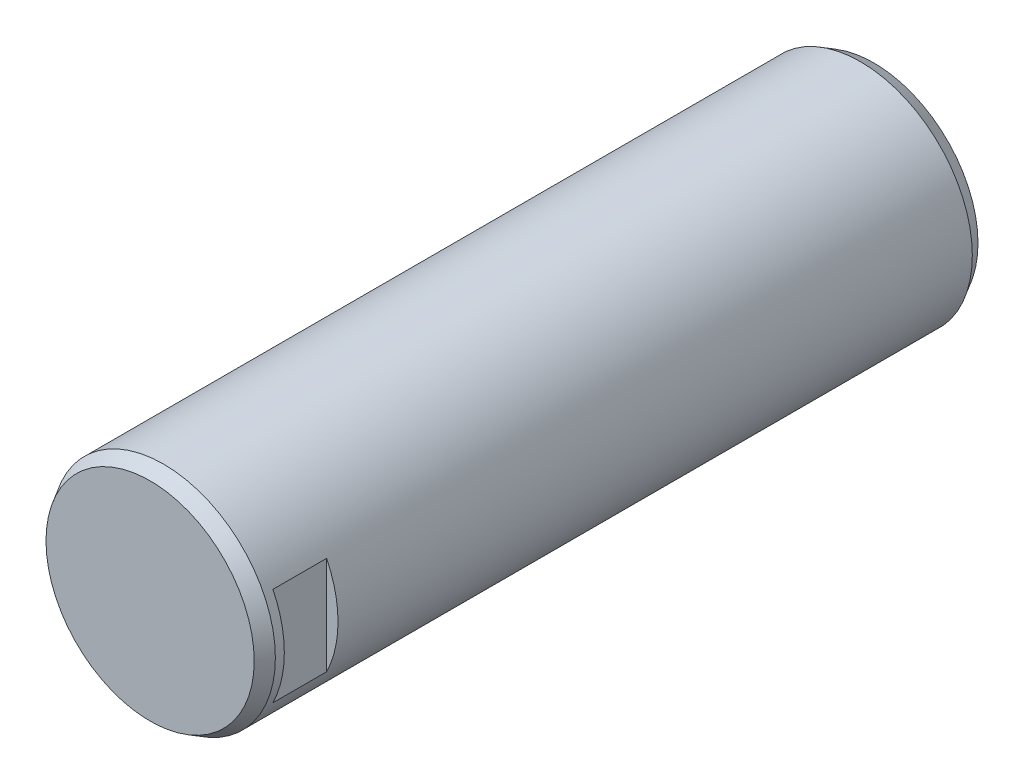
from build123d import *

# Parameters (mm, degrees)
SKETCH1_R           = 25
BOSS_EXTRUDE1_DEPTH = 80.89
CHAMFER1_SIZE       = 3
CHAMFER1_SIZE2      = 1.732050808
CHAMFER2_SIZE       = 3
CHAMFER2_SIZE2      = 1.732050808
SKETCH2_W           = 12
SKETCH2_H           = 42.321588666
CUT_EXTRUDE1_DEPTH  = 2.54


with BuildPart() as part:
    # Sketch1 → Boss-Extrude1 (new, symmetric)
    with BuildSketch(Plane.XY):
        with Locations(Location((0, 0, 0), (0, 0, 180))):
            Circle(SKETCH1_R)
    extrude(amount=BOSS_EXTRUDE1_DEPTH, both=True)

    # Chamfer1
    chamfer1_edges = [part.edges().sort_by_distance(p)[0] for p in [
        (25, 0, 80.89),
    ]]
    chamfer1_side = [part.faces().sort_by_distance(p)[0] for p in [
        (25, 0, 0),
    ]]
    chamfer(chamfer1_edges, length=CHAMFER1_SIZE, length2=CHAMFER1_SIZE2, reference=chamfer1_side[0])

    # Chamfer2
    chamfer2_edges = [part.edges().sort_by_distance(p)[0] for p in [
        (25, 0, -80.89),
    ]]
    chamfer2_side = [part.faces().sort_by_distance(p)[0] for p in [
        (25, 0, -1.5),
    ]]
    chamfer(chamfer2_edges, length=CHAMFER2_SIZE, length2=CHAMFER2_SIZE2, reference=chamfer2_side[0])

    # Sketch2 → Cut-Extrude1 (cut)
    with BuildSketch(Plane(origin=(25, 0, 0), x_dir=(0, 0, -1), z_dir=(1, 0, 0))):
        with Locations((-69.89, 0)):
            Rectangle(SKETCH2_W, SKETCH2_H)
    extrude(amount=-CUT_EXTRUDE1_DEPTH, mode=Mode.SUBTRACT)


solid = part.part
